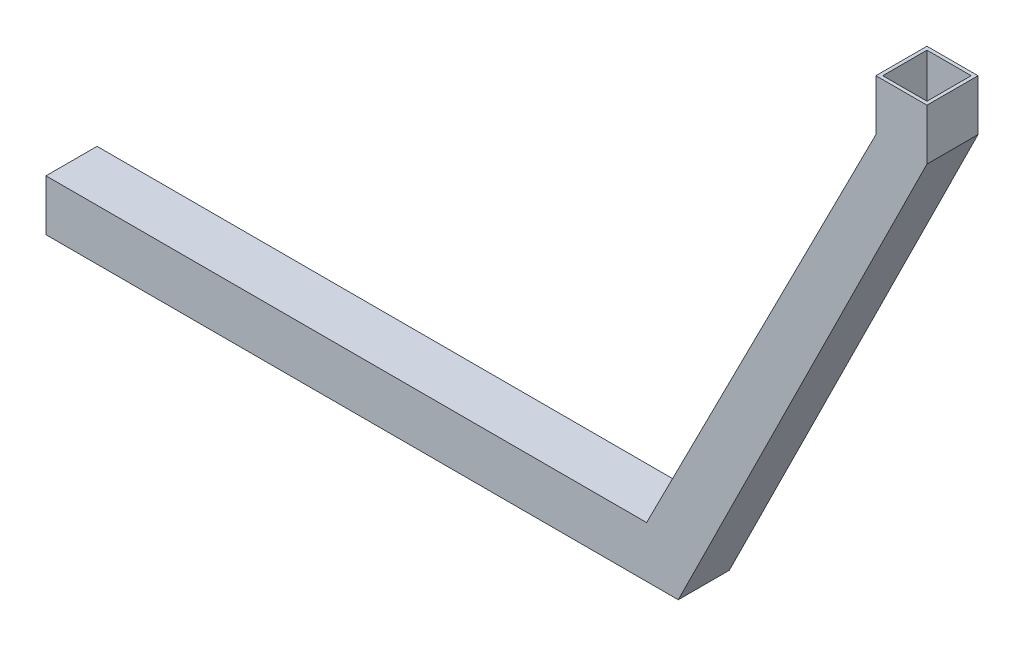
from build123d import *

# Parameters (mm, degrees)
BOSS_EXTRU_1_DEPTH      = 30
COQUE1_T                = -2
ESQUISSE2_W             = 26
ESQUISSE2_H             = 26
ENL_V_MAT_EXTRU_1_DEPTH = 30


with BuildPart() as part:
    # Esquisse1 → Boss.-Extru.1 (new body)
    with BuildSketch(Plane.XY):
        Polygon((142.457793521, -15), (183.748297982, -15), (329.885684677, 279.8), (329.885684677, 309.8), (299.885684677, 309.8), (299.885684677, 279.8), (165.136054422, 15), (-187.814315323, 15), (-187.814315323, -15), align=None)
    extrude(amount=BOSS_EXTRU_1_DEPTH)

    # Coque1
    coque1_openings = [part.faces().sort_by_distance(p)[0] for p in [
        (314.885684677, 309.8, 15),
    ]]
    offset(amount=COQUE1_T, openings=coque1_openings, kind=Kind.INTERSECTION)

    # Esquisse2 → Enl_v. mat.-Extru.1 (cut)
    with BuildSketch(Plane.ZY.offset(187.814315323)):
        with Locations((15, 0)):
            Rectangle(ESQUISSE2_W, ESQUISSE2_H)
    extrude(amount=-ENL_V_MAT_EXTRU_1_DEPTH, mode=Mode.SUBTRACT)


solid = part.part
